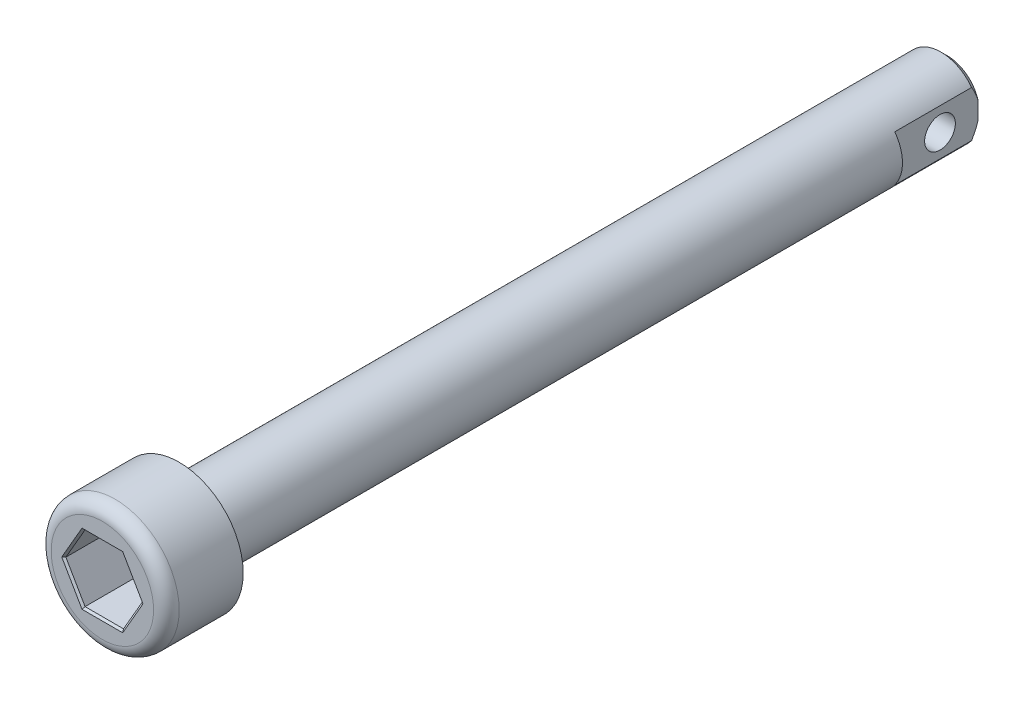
from build123d import *

# Parameters (mm, degrees)
ESQUISSE1_R             = 5
BASE_EXTRUSION_DEPTH    = 6
ENL_V_MAT_EXTRU_1_DEPTH = 4
CONG_1_R                = 1
CHANFREIN3_SIZE         = 0.15
ESQUISSE4_R             = 3
BOSS_EXTRU_1_DEPTH      = 60
CHANFREIN4_SIZE         = 0.5
ESQUISSE5_W             = 1.725795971
ESQUISSE5_H             = 5.746530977
ENL_V_MAT_EXTRU_2_DEPTH = 6.5
ESQUISSE6_W             = 1.6
ESQUISSE6_H             = 6
ENL_V_MAT_EXTRU_3_DEPTH = 6.5
ESQUISSE7_R             = 1.2
ENL_V_MAT_EXTRU_4_DEPTH = 61.661025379


with BuildPart() as part:
    # Esquisse1 → Base-Extrusion (new body)
    with BuildSketch(Plane.XY):
        Circle(ESQUISSE1_R)
    extrude(amount=BASE_EXTRUSION_DEPTH)

    # Esquisse3 → Enl_v. mat.-Extru.1 (cut)
    with BuildSketch(Plane.XY.offset(6)):
        Polygon((-3, 0), (-1.502673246, 2.596530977), (1.502673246, 2.596530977), (3, 0), (1.502673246, -2.596530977), (-1.502673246, -2.596530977), align=None)
    extrude(amount=-ENL_V_MAT_EXTRU_1_DEPTH, mode=Mode.SUBTRACT)

    # Cong_1
    cong_1_edges = [part.edges().sort_by_distance(p)[0] for p in [
        (-5, 0, 6),
    ]]
    fillet(cong_1_edges, radius=CONG_1_R)

    # Chanfrein3
    chanfrein3_edges = [part.edges().sort_by_distance(p)[0] for p in [
        (-2.251336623, -1.298265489, 6),
        (0, -2.596530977, 6),
        (2.251336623, -1.298265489, 6),
        (2.251336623, 1.298265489, 6),
        (0, 2.596530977, 6),
        (-2.251336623, 1.298265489, 6),
    ]]
    chamfer(chanfrein3_edges, length=CHANFREIN3_SIZE)

    # Esquisse4 → Boss.-Extru.1 (add)
    with BuildSketch(Plane(origin=(0, 0, 0), x_dir=(-1, 0, 0), z_dir=(0, 0, -1))):
        with Locations(Location((0, 0, 0), (0, 0, 216.869897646))):
            Circle(ESQUISSE4_R)
    extrude(amount=BOSS_EXTRU_1_DEPTH)

    # Chanfrein4
    chanfrein4_edges = [part.edges().sort_by_distance(p)[0] for p in [
        (-2.4, 1.8, -60),
    ]]
    chamfer(chanfrein4_edges, length=CHANFREIN4_SIZE)

    # Esquisse5 → Enl_v. mat.-Extru.2 (cut)
    with BuildSketch(Plane(origin=(0, 0, -60), x_dir=(-1, 0, 0), z_dir=(0, 0, -1))):
        with Locations((-3.262897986, 0.126734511)):
            Rectangle(ESQUISSE5_W, ESQUISSE5_H)
    extrude(amount=-ENL_V_MAT_EXTRU_2_DEPTH, mode=Mode.SUBTRACT)

    # Esquisse6 → Enl_v. mat.-Extru.3 (cut)
    with BuildSketch(Plane(origin=(0, 0, -60), x_dir=(-1, 0, 0), z_dir=(0, 0, -1))):
        with Locations((3.2, 0)):
            Rectangle(ESQUISSE6_W, ESQUISSE6_H)
    extrude(amount=-ENL_V_MAT_EXTRU_3_DEPTH, mode=Mode.SUBTRACT)

    # Esquisse7 → Enl_v. mat.-Extru.4 (cut, through all)
    with BuildSketch(Plane(origin=(2.4, 0, 0), x_dir=(0, 0, -1), z_dir=(1, 0, 0))):
        with Locations((57.030411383, 0)):
            Circle(ESQUISSE7_R)
    extrude(amount=-ENL_V_MAT_EXTRU_4_DEPTH, mode=Mode.SUBTRACT)


solid = part.part
